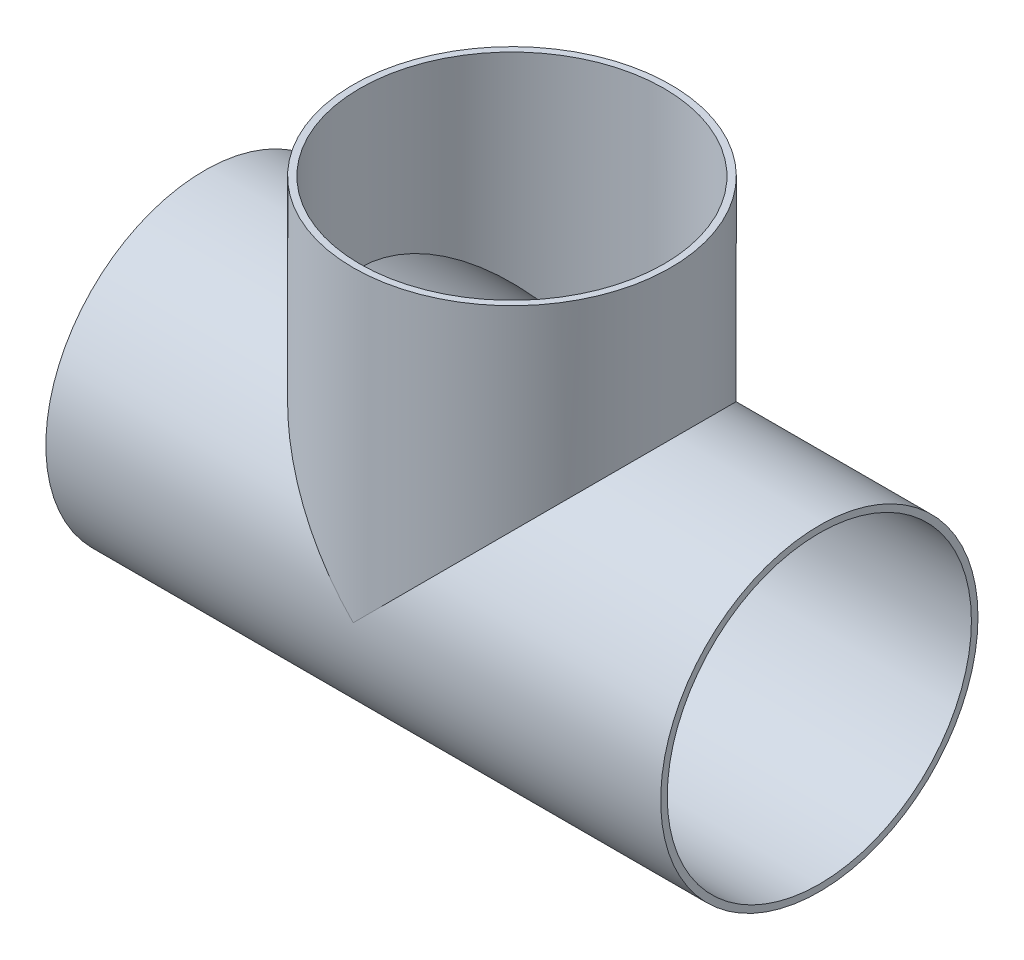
ISO-10303-21;
HEADER;
FILE_DESCRIPTION(('STEP AP214'),'2;1');
FILE_NAME('part.step','',(''),(''),'','','');
FILE_SCHEMA(('AUTOMOTIVE_DESIGN { 1 0 10303 214 1 1 1 1 }'));
ENDSEC;
DATA;
#1=APPLICATION_CONTEXT('core data for automotive mechanical design processes');
#2=APPLICATION_PROTOCOL_DEFINITION('international standard','automotive_design',2000,#1);
#3=PRODUCT_CONTEXT('',#1,'mechanical');
#4=PRODUCT('Part','Part','',(#3));
#5=PRODUCT_RELATED_PRODUCT_CATEGORY('part','',(#4));
#6=PRODUCT_DEFINITION_FORMATION('','',#4);
#7=PRODUCT_DEFINITION_CONTEXT('part definition',#1,'design');
#8=PRODUCT_DEFINITION('design','',#6,#7);
#9=PRODUCT_DEFINITION_SHAPE('','',#8);
#10=(LENGTH_UNIT() NAMED_UNIT(*) SI_UNIT(.MILLI.,.METRE.));
#11=(NAMED_UNIT(*) PLANE_ANGLE_UNIT() SI_UNIT($,.RADIAN.));
#12=(NAMED_UNIT(*) SI_UNIT($,.STERADIAN.) SOLID_ANGLE_UNIT());
#13=UNCERTAINTY_MEASURE_WITH_UNIT(LENGTH_MEASURE(1.E-05),#10,'distance_accuracy_value','');
#14=(GEOMETRIC_REPRESENTATION_CONTEXT(3) GLOBAL_UNCERTAINTY_ASSIGNED_CONTEXT((#13)) GLOBAL_UNIT_ASSIGNED_CONTEXT((#10,
#11,#12)) REPRESENTATION_CONTEXT('',''));
#15=CARTESIAN_POINT('',(0.,0.,0.));
#16=DIRECTION('',(0.,0.,1.));
#17=DIRECTION('',(1.,0.,0.));
#18=AXIS2_PLACEMENT_3D('',#15,#16,#17);
#19=CARTESIAN_POINT('',(0.,98.425,0.));
#20=DIRECTION('',(0.,1.,0.));
#21=DIRECTION('',(0.,0.,1.));
#22=AXIS2_PLACEMENT_3D('',#19,#20,#21);
#23=PLANE('',#22);
#24=CARTESIAN_POINT('',(0.,98.425,0.));
#25=DIRECTION('',(0.,1.,0.));
#26=DIRECTION('',(0.,0.,1.));
#27=AXIS2_PLACEMENT_3D('',#24,#25,#26);
#28=CIRCLE('',#27,50.8);
#29=CARTESIAN_POINT('',(0.,98.425,50.8));
#30=VERTEX_POINT('',#29);
#31=EDGE_CURVE('E68',#30,#30,#28,.T.);
#32=ORIENTED_EDGE('',*,*,#31,.T.);
#33=EDGE_LOOP('',(#32));
#34=FACE_BOUND('',#33,.T.);
#35=CARTESIAN_POINT('',(0.,98.425,0.));
#36=DIRECTION('',(0.,1.,0.));
#37=DIRECTION('',(0.,0.,1.));
#38=AXIS2_PLACEMENT_3D('',#35,#36,#37);
#39=CIRCLE('',#38,48.6918);
#40=CARTESIAN_POINT('',(0.,98.425,48.6918));
#41=VERTEX_POINT('',#40);
#42=EDGE_CURVE('E65',#41,#41,#39,.T.);
#43=ORIENTED_EDGE('',*,*,#42,.F.);
#44=EDGE_LOOP('',(#43));
#45=FACE_BOUND('',#44,.T.);
#46=ADVANCED_FACE('F33',(#34,#45),#23,.T.);
#47=CARTESIAN_POINT('',(98.425,0.,0.));
#48=DIRECTION('',(-1.,0.,0.));
#49=DIRECTION('',(0.,0.,1.));
#50=AXIS2_PLACEMENT_3D('',#47,#48,#49);
#51=CYLINDRICAL_SURFACE('',#50,50.8);
#52=CARTESIAN_POINT('',(-98.425,0.,0.));
#53=DIRECTION('',(1.,0.,0.));
#54=DIRECTION('',(0.,0.,-1.));
#55=AXIS2_PLACEMENT_3D('',#52,#53,#54);
#56=CIRCLE('',#55,50.8);
#57=CARTESIAN_POINT('',(-98.425,0.,-50.8));
#58=VERTEX_POINT('',#57);
#59=EDGE_CURVE('E74',#58,#58,#56,.T.);
#60=ORIENTED_EDGE('',*,*,#59,.T.);
#61=EDGE_LOOP('',(#60));
#62=FACE_BOUND('',#61,.T.);
#63=CARTESIAN_POINT('',(98.425,0.,0.));
#64=DIRECTION('',(1.,0.,0.));
#65=DIRECTION('',(0.,0.,-1.));
#66=AXIS2_PLACEMENT_3D('',#63,#64,#65);
#67=CIRCLE('',#66,50.8);
#68=CARTESIAN_POINT('',(98.425,0.,-50.8));
#69=VERTEX_POINT('',#68);
#70=EDGE_CURVE('E75',#69,#69,#67,.T.);
#71=ORIENTED_EDGE('',*,*,#70,.F.);
#72=EDGE_LOOP('',(#71));
#73=FACE_BOUND('',#72,.T.);
#74=CARTESIAN_POINT('',(0.,0.,0.));
#75=DIRECTION('',(-0.707106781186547,-0.707106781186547,0.));
#76=DIRECTION('',(-0.707106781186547,0.707106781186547,0.));
#77=AXIS2_PLACEMENT_3D('',#74,#75,#76);
#78=ELLIPSE('',#77,71.8420489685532,50.8);
#79=CARTESIAN_POINT('',(0.,0.,-50.8));
#80=VERTEX_POINT('',#79);
#81=CARTESIAN_POINT('',(0.,0.,50.8));
#82=VERTEX_POINT('',#81);
#83=EDGE_CURVE('E11',#80,#82,#78,.F.);
#84=ORIENTED_EDGE('',*,*,#83,.F.);
#85=CARTESIAN_POINT('',(0.,0.,0.));
#86=DIRECTION('',(-0.707106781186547,0.707106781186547,0.));
#87=DIRECTION('',(-0.707106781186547,-0.707106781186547,0.));
#88=AXIS2_PLACEMENT_3D('',#85,#86,#87);
#89=ELLIPSE('',#88,71.8420489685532,50.8);
#90=EDGE_CURVE('E41',#82,#80,#89,.T.);
#91=ORIENTED_EDGE('',*,*,#90,.F.);
#92=EDGE_LOOP('',(#84,#91));
#93=FACE_BOUND('',#92,.T.);
#94=ADVANCED_FACE('F35',(#62,#73,#93),#51,.T.);
#95=CARTESIAN_POINT('',(98.425,0.,0.));
#96=DIRECTION('',(1.,0.,0.));
#97=DIRECTION('',(0.,0.,-1.));
#98=AXIS2_PLACEMENT_3D('',#95,#96,#97);
#99=PLANE('',#98);
#100=CARTESIAN_POINT('',(98.425,0.,0.));
#101=DIRECTION('',(1.,0.,0.));
#102=DIRECTION('',(0.,0.,-1.));
#103=AXIS2_PLACEMENT_3D('',#100,#101,#102);
#104=CIRCLE('',#103,48.6918);
#105=CARTESIAN_POINT('',(98.425,0.,-48.6918));
#106=VERTEX_POINT('',#105);
#107=EDGE_CURVE('E149',#106,#106,#104,.T.);
#108=ORIENTED_EDGE('',*,*,#107,.F.);
#109=EDGE_LOOP('',(#108));
#110=FACE_BOUND('',#109,.T.);
#111=ORIENTED_EDGE('',*,*,#70,.T.);
#112=EDGE_LOOP('',(#111));
#113=FACE_BOUND('',#112,.T.);
#114=ADVANCED_FACE('F82',(#110,#113),#99,.T.);
#115=CARTESIAN_POINT('',(-98.425,0.,0.));
#116=DIRECTION('',(1.,0.,0.));
#117=DIRECTION('',(0.,0.,-1.));
#118=AXIS2_PLACEMENT_3D('',#115,#116,#117);
#119=PLANE('',#118);
#120=CARTESIAN_POINT('',(-98.425,0.,0.));
#121=DIRECTION('',(1.,0.,0.));
#122=DIRECTION('',(0.,0.,-1.));
#123=AXIS2_PLACEMENT_3D('',#120,#121,#122);
#124=CIRCLE('',#123,48.6918);
#125=CARTESIAN_POINT('',(-98.425,0.,-48.6918));
#126=VERTEX_POINT('',#125);
#127=EDGE_CURVE('E61',#126,#126,#124,.T.);
#128=ORIENTED_EDGE('',*,*,#127,.T.);
#129=EDGE_LOOP('',(#128));
#130=FACE_BOUND('',#129,.T.);
#131=ORIENTED_EDGE('',*,*,#59,.F.);
#132=EDGE_LOOP('',(#131));
#133=FACE_BOUND('',#132,.T.);
#134=ADVANCED_FACE('F88',(#130,#133),#119,.F.);
#135=CARTESIAN_POINT('',(0.,98.425,0.));
#136=DIRECTION('',(0.,-1.,0.));
#137=DIRECTION('',(0.,0.,-1.));
#138=AXIS2_PLACEMENT_3D('',#135,#136,#137);
#139=CYLINDRICAL_SURFACE('',#138,50.8);
#140=ORIENTED_EDGE('',*,*,#31,.F.);
#141=EDGE_LOOP('',(#140));
#142=FACE_BOUND('',#141,.T.);
#143=ORIENTED_EDGE('',*,*,#90,.T.);
#144=ORIENTED_EDGE('',*,*,#83,.T.);
#145=EDGE_LOOP('',(#143,#144));
#146=FACE_BOUND('',#145,.T.);
#147=ADVANCED_FACE('F80',(#142,#146),#139,.T.);
#148=CARTESIAN_POINT('',(0.,98.425,0.));
#149=DIRECTION('',(0.,-1.,0.));
#150=DIRECTION('',(0.,0.,-1.));
#151=AXIS2_PLACEMENT_3D('',#148,#149,#150);
#152=CYLINDRICAL_SURFACE('',#151,48.6918);
#153=CARTESIAN_POINT('',(0.,0.,0.));
#154=DIRECTION('',(0.707106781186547,-0.707106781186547,0.));
#155=DIRECTION('',(-0.707106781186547,-0.707106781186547,0.));
#156=AXIS2_PLACEMENT_3D('',#153,#154,#155);
#157=ELLIPSE('',#156,68.8606039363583,48.6918);
#158=CARTESIAN_POINT('',(0.,0.,48.6918));
#159=VERTEX_POINT('',#158);
#160=CARTESIAN_POINT('',(0.,0.,-48.6918));
#161=VERTEX_POINT('',#160);
#162=EDGE_CURVE('E47',#159,#161,#157,.F.);
#163=ORIENTED_EDGE('',*,*,#162,.F.);
#164=CARTESIAN_POINT('',(0.,0.,0.));
#165=DIRECTION('',(-0.707106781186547,-0.707106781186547,0.));
#166=DIRECTION('',(0.707106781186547,-0.707106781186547,0.));
#167=AXIS2_PLACEMENT_3D('',#164,#165,#166);
#168=ELLIPSE('',#167,68.8606039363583,48.6918);
#169=EDGE_CURVE('E57',#161,#159,#168,.F.);
#170=ORIENTED_EDGE('',*,*,#169,.F.);
#171=EDGE_LOOP('',(#163,#170));
#172=FACE_BOUND('',#171,.T.);
#173=ORIENTED_EDGE('',*,*,#42,.T.);
#174=EDGE_LOOP('',(#173));
#175=FACE_BOUND('',#174,.T.);
#176=ADVANCED_FACE('F63',(#172,#175),#152,.F.);
#177=CARTESIAN_POINT('',(-98.425,0.,0.));
#178=DIRECTION('',(1.,0.,0.));
#179=DIRECTION('',(0.,0.,-1.));
#180=AXIS2_PLACEMENT_3D('',#177,#178,#179);
#181=CYLINDRICAL_SURFACE('',#180,48.6918);
#182=ORIENTED_EDGE('',*,*,#162,.T.);
#183=ORIENTED_EDGE('',*,*,#169,.T.);
#184=EDGE_LOOP('',(#182,#183));
#185=FACE_BOUND('',#184,.T.);
#186=ORIENTED_EDGE('',*,*,#127,.F.);
#187=EDGE_LOOP('',(#186));
#188=FACE_BOUND('',#187,.T.);
#189=ORIENTED_EDGE('',*,*,#107,.T.);
#190=EDGE_LOOP('',(#189));
#191=FACE_BOUND('',#190,.T.);
#192=ADVANCED_FACE('F58',(#185,#188,#191),#181,.F.);
#193=CLOSED_SHELL('',(#46,#94,#114,#134,#147,#176,#192));
#194=MANIFOLD_SOLID_BREP('B2',#193);
#195=ADVANCED_BREP_SHAPE_REPRESENTATION('',(#18,#194),#14);
#196=SHAPE_DEFINITION_REPRESENTATION(#9,#195);
ENDSEC;
END-ISO-10303-21;
